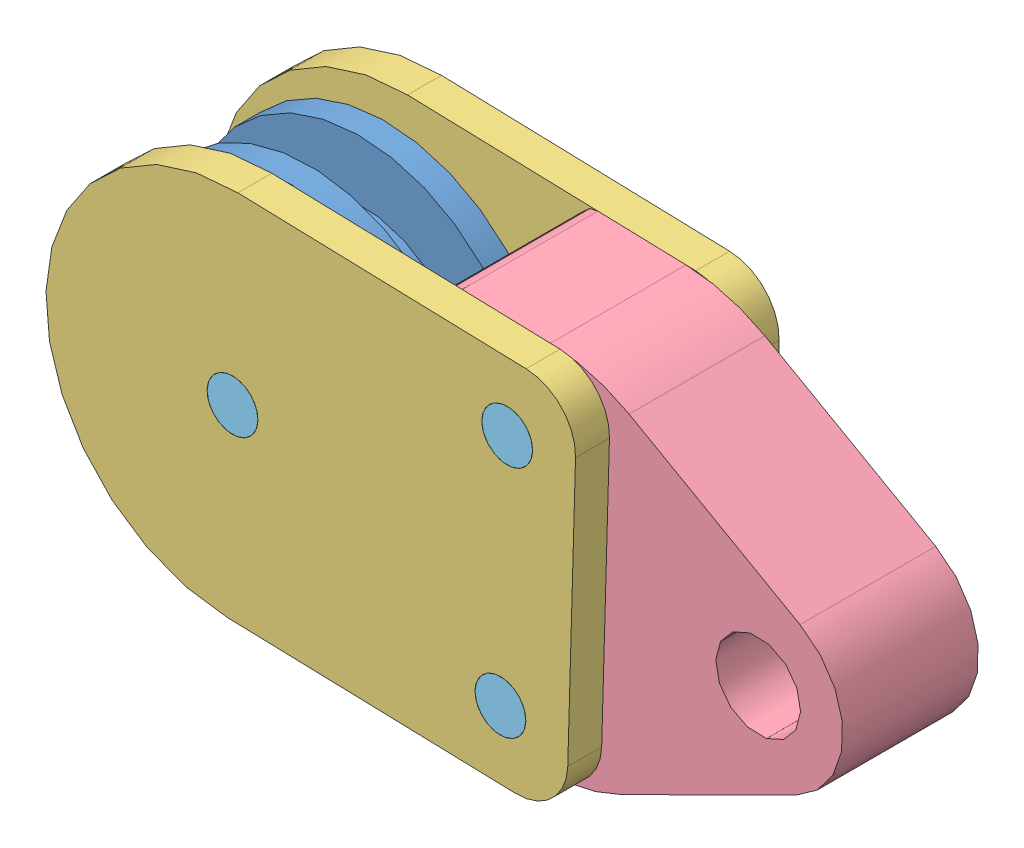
SolidWorks assembly Poulie simple.SLDASM, configuration Défaut (file format 5000). Lengths in mm.
Overall size (46.59 24.59 12).
10 component instances, 5 part files, 14 mates.
Components (placement in the parent):
- Poulie  assemblée-1: Poulie  assemblée.SLDASM [Défaut] at (-2.4611 -0.2783 0) size (24.59 24.59 8)
  - Demi-poulie-1: Demi-poulie.SLDPRT [Défaut] at (1.5761 1.4982 0) size (20 20 3)
  - Demi-poulie-2: Demi-poulie.SLDPRT [Défaut] at (1.5761 1.4982 0) x (0.964218 0.26511 0) z (0 0 -1) size (20 20 3)
  - Axe laiton poulie simple-1: Axe laiton poulie simple.SLDPRT [Défaut] at (1.5761 1.4982 -4) x (0.816768 0.576966 0) z (0 0 1) size (4 4 8)
- Flasque-palan-1: Flasque-palan.SLDPRT [Défaut] at (-0.885 1.2199 -6) x (0.99959 -0.028645 0) z (0 0 1) size (31 22 2)
- Flasque-palan-2: Flasque-palan.SLDPRT [Défaut] at (-0.885 1.2199 4) x (0.99959 -0.028645 0) z (0 0 1) size (31 22 2)
- Flasque-palan-inter-1: Flasque-palan-inter.SLDPRT [Défaut] at (-1.8846 1.2485 -4) x (0.99959 -0.028645 0) z (0 0 1) size (23.77 22 8)
- Axe 3x12-1: Axe 3x12.SLDPRT [Défaut] at (15.3089 7.7587 -6) size (3 3 12)
- Axe 3x12-2: Axe 3x12.SLDPRT [Défaut] at (14.9079 -6.2356 -6) size (3 3 12)
- Axe 3x12-3: Axe 3x12.SLDPRT [Défaut] at (-0.885 1.2199 -6) size (3 3 12)
Mates (geometry in assembly coordinates):
- Coaxiale2: concentric aligned: cylinder of Poulie  assemblée-1/Axe laiton poulie simple-1 through (-0.885 1.2199 4) axis (0 0 -1) radius 1.55; cylinder of Flasque-palan-2 through (-0.885 1.2199 6) axis (0 0 -1) radius 1.5
- Coaxiale3: concentric aligned: cylinder of Flasque-palan-1 through (-0.885 1.2199 -4) axis (0 0 -1) radius 1.5; cylinder of Flasque-palan-2 through (-0.885 1.2199 6) axis (0 0 -1) radius 1.5
- Coïncidente1: coincident anti-aligned: plane of Poulie  assemblée-1/Axe laiton poulie simple-1 through (-0.885 1.2199 4) normal (0 0 1); plane of Flasque-palan-2 through (-0.885 1.2199 4) normal (0 0 -1)
- Coïncidente2: coincident anti-aligned: plane of Poulie  assemblée-1/Axe laiton poulie simple-1 through (-0.885 1.2199 -4) normal (0 0 -1); plane of Flasque-palan-1 through (-0.885 1.2199 -4) normal (0 0 1)
- Coaxiale4: concentric aligned: cylinder of Flasque-palan-2 through (15.3089 7.7587 6) axis (0 0 -1) radius 1.5; cylinder of Flasque-palan-inter-1 through (15.3089 7.7587 4) axis (0 0 -1) radius 1.5
- Coaxiale5: concentric aligned: cylinder of Flasque-palan-2 through (14.9079 -6.2356 6) axis (0 0 -1) radius 1.5; cylinder of Flasque-palan-inter-1 through (14.9079 -6.2356 4) axis (0 0 -1) radius 1.5
- Coïncidente3: coincident anti-aligned: plane of Flasque-palan-2 through (-0.885 1.2199 4) normal (0 0 -1); plane of Flasque-palan-inter-1 through (10.6248 10.8942 4) normal (0 0 1)
- Coaxiale6: concentric aligned: cylinder of Flasque-palan-1 through (15.3089 7.7587 -4) axis (0 0 -1) radius 1.5; cylinder of Flasque-palan-inter-1 through (15.3089 7.7587 4) axis (0 0 -1) radius 1.5
- Coaxiale7: concentric aligned: cylinder of Flasque-palan-2 through (15.3089 7.7587 6) axis (0 0 -1) radius 1.5; cylinder of Axe 3x12-1 through (15.3089 7.7587 6) axis (0 0 -1) radius 1.5
- Coïncidente4: coincident aligned: plane of Flasque-palan-2 through (-0.885 1.2199 6) normal (0 0 1); plane of Axe 3x12-1 through (15.3089 7.7587 6) normal (0 0 1)
- Coaxiale8: concentric aligned: cylinder of Flasque-palan-inter-1 through (14.9079 -6.2356 4) axis (0 0 -1) radius 1.5; cylinder of Axe 3x12-2 through (14.9079 -6.2356 6) axis (0 0 -1) radius 1.5
- Coïncidente5: coincident aligned: plane of Flasque-palan-2 through (-0.885 1.2199 6) normal (0 0 1); plane of Axe 3x12-2 through (14.9079 -6.2356 6) normal (0 0 1)
- Coaxiale9: concentric aligned: cylinder of Poulie  assemblée-1/Axe laiton poulie simple-1 through (-0.885 1.2199 4) axis (0 0 -1) radius 1.55; cylinder of Axe 3x12-3 through (-0.885 1.2199 6) axis (0 0 -1) radius 1.5
- Coïncidente6: coincident aligned: plane of Flasque-palan-2 through (-0.885 1.2199 6) normal (0 0 1); plane of Axe 3x12-3 through (-0.885 1.2199 6) normal (0 0 1)
